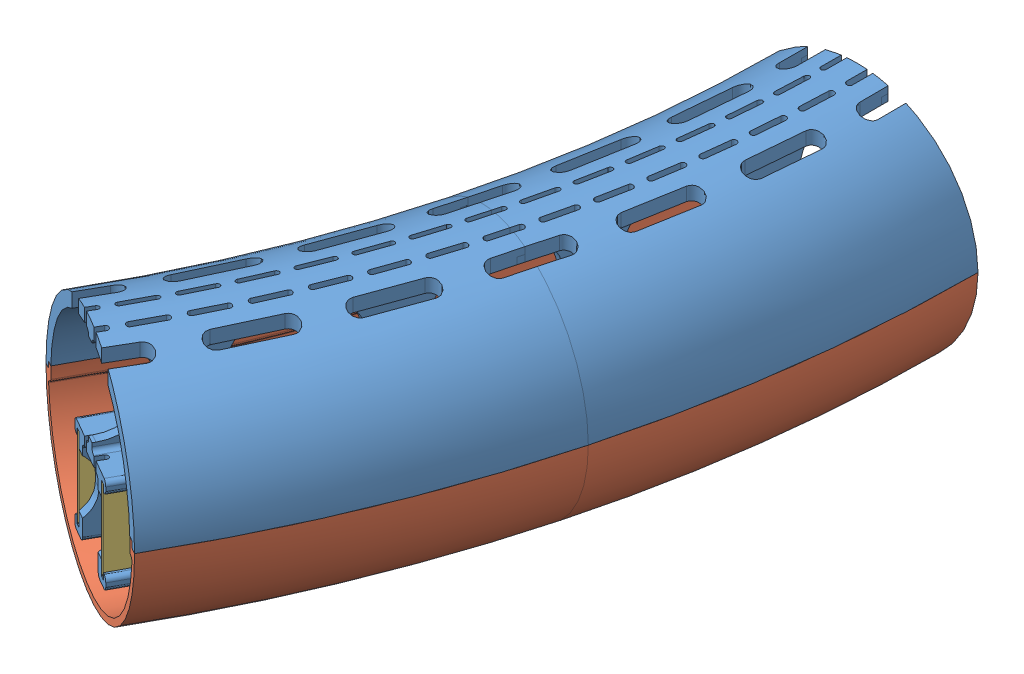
SolidWorks assembly min_30.SLDASM, configuration По умолчанию (file format 12000). Lengths in mm.
Overall size (50.1 30 83.96).
8 component instances, 3 part files, 2 mates.
Components (placement in the parent):
- min_15-1: min_15.SLDASM [По умолчанию] at (0.8046 0.6477 0.6225) size (34.6 30 42.71)
  - min_frame-1: min_frame.SLDPRT [По умолчанию] at (-122.2259 30.5048 -5.4377) size (34.6 25.85 42.71)
  - min_glass-1: min_glass.SLDPRT [По умолчанию] at (-122.2259 30.5048 -5.4377) size (34.6 15.78 42.71)
  - min_led-1: min_led.SLDPRT [По умолчанию] at (-122.2259 30.5048 -5.4377) size (13.66 10 39.95)
- min_15-2: min_15.SLDASM [По умолчанию] at (-4.7675 0.6477 32.0716) x (0.965926 0 0.258819) z (-0.258819 0 0.965926) size (34.6 30 42.71)
  - min_frame-1: min_frame.SLDPRT [По умолчанию] at (-122.2259 30.5048 -5.4377) size (34.6 25.85 42.71)
  - min_glass-1: min_glass.SLDPRT [По умолчанию] at (-122.2259 30.5048 -5.4377) size (34.6 15.78 42.71)
  - min_led-1: min_led.SLDPRT [По умолчанию] at (-122.2259 30.5048 -5.4377) size (13.66 10 39.95)
Mates (geometry in assembly coordinates):
- Совпадение1: coincident aligned: circle of 15-1/min_frame-1; circle of 15-2/min_frame-1
- Совпадение2: coincident: point of 15-1/min_frame-1; point of 15-2/min_frame-1
